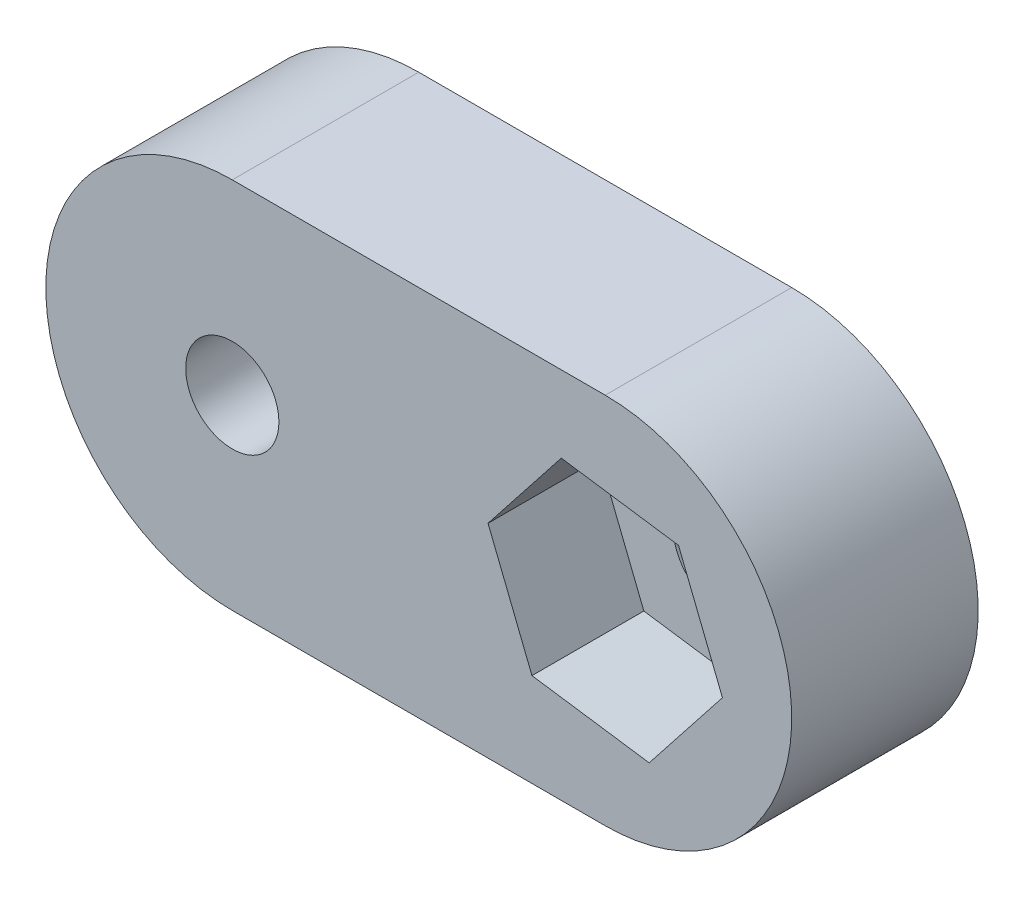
ISO-10303-21;
HEADER;
FILE_DESCRIPTION(('STEP AP214'),'2;1');
FILE_NAME('part.step','',(''),(''),'','','');
FILE_SCHEMA(('AUTOMOTIVE_DESIGN { 1 0 10303 214 1 1 1 1 }'));
ENDSEC;
DATA;
#1=APPLICATION_CONTEXT('core data for automotive mechanical design processes');
#2=APPLICATION_PROTOCOL_DEFINITION('international standard','automotive_design',2000,#1);
#3=PRODUCT_CONTEXT('',#1,'mechanical');
#4=PRODUCT('Part','Part','',(#3));
#5=PRODUCT_RELATED_PRODUCT_CATEGORY('part','',(#4));
#6=PRODUCT_DEFINITION_FORMATION('','',#4);
#7=PRODUCT_DEFINITION_CONTEXT('part definition',#1,'design');
#8=PRODUCT_DEFINITION('design','',#6,#7);
#9=PRODUCT_DEFINITION_SHAPE('','',#8);
#10=(LENGTH_UNIT() NAMED_UNIT(*) SI_UNIT(.MILLI.,.METRE.));
#11=(NAMED_UNIT(*) PLANE_ANGLE_UNIT() SI_UNIT($,.RADIAN.));
#12=(NAMED_UNIT(*) SI_UNIT($,.STERADIAN.) SOLID_ANGLE_UNIT());
#13=UNCERTAINTY_MEASURE_WITH_UNIT(LENGTH_MEASURE(1.E-05),#10,'distance_accuracy_value','');
#14=(GEOMETRIC_REPRESENTATION_CONTEXT(3) GLOBAL_UNCERTAINTY_ASSIGNED_CONTEXT((#13)) GLOBAL_UNIT_ASSIGNED_CONTEXT((#10,
#11,#12)) REPRESENTATION_CONTEXT('',''));
#15=CARTESIAN_POINT('',(0.,0.,0.));
#16=DIRECTION('',(0.,0.,1.));
#17=DIRECTION('',(1.,0.,0.));
#18=AXIS2_PLACEMENT_3D('',#15,#16,#17);
#19=CARTESIAN_POINT('',(1.17833373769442,2.94870529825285,5.));
#20=DIRECTION('',(0.142936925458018,-0.989731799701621,0.));
#21=DIRECTION('',(0.989731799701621,0.142936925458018,0.));
#22=AXIS2_PLACEMENT_3D('',#19,#20,#21);
#23=PLANE('',#22);
#24=DIRECTION('',(0.,0.,-1.));
#25=VECTOR('',#24,1.);
#26=CARTESIAN_POINT('',(1.17833373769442,2.94870529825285,5.));
#27=LINE('',#26,#25);
#28=CARTESIAN_POINT('',(1.17833373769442,2.94870529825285,3.));
#29=VERTEX_POINT('',#28);
#30=CARTESIAN_POINT('',(1.17833373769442,2.94870529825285,0.));
#31=VERTEX_POINT('',#30);
#32=EDGE_CURVE('E241',#29,#31,#27,.T.);
#33=ORIENTED_EDGE('',*,*,#32,.F.);
#34=DIRECTION('',(-0.989731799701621,-0.142936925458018,0.));
#35=VECTOR('',#34,1.);
#36=CARTESIAN_POINT('',(1.17833373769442,2.94870529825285,3.));
#37=LINE('',#36,#35);
#38=CARTESIAN_POINT('',(-1.96448682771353,2.49481960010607,3.));
#39=VERTEX_POINT('',#38);
#40=EDGE_CURVE('E190',#29,#39,#37,.T.);
#41=ORIENTED_EDGE('',*,*,#40,.T.);
#42=DIRECTION('',(0.,0.,-1.));
#43=VECTOR('',#42,1.);
#44=CARTESIAN_POINT('',(-1.96448682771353,2.49481960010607,5.));
#45=LINE('',#44,#43);
#46=CARTESIAN_POINT('',(-1.96448682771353,2.49481960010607,0.));
#47=VERTEX_POINT('',#46);
#48=EDGE_CURVE('E251',#39,#47,#45,.T.);
#49=ORIENTED_EDGE('',*,*,#48,.T.);
#50=DIRECTION('',(-0.989731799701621,-0.142936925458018,0.));
#51=VECTOR('',#50,1.);
#52=CARTESIAN_POINT('',(1.17833373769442,2.94870529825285,0.));
#53=LINE('',#52,#51);
#54=EDGE_CURVE('E223',#31,#47,#53,.T.);
#55=ORIENTED_EDGE('',*,*,#54,.F.);
#56=EDGE_LOOP('',(#33,#41,#49,#55));
#57=FACE_BOUND('',#56,.T.);
#58=ADVANCED_FACE('F34',(#57),#23,.T.);
#59=CARTESIAN_POINT('',(-1.96448682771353,2.49481960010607,5.));
#60=DIRECTION('',(0.928601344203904,-0.371078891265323,0.));
#61=DIRECTION('',(0.371078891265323,0.928601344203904,0.));
#62=AXIS2_PLACEMENT_3D('',#59,#60,#61);
#63=PLANE('',#62);
#64=ORIENTED_EDGE('',*,*,#48,.F.);
#65=DIRECTION('',(-0.371078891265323,-0.928601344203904,0.));
#66=VECTOR('',#65,1.);
#67=CARTESIAN_POINT('',(-1.96448682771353,2.49481960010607,3.));
#68=LINE('',#67,#66);
#69=CARTESIAN_POINT('',(-3.14282056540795,-0.453885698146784,3.));
#70=VERTEX_POINT('',#69);
#71=EDGE_CURVE('E193',#39,#70,#68,.T.);
#72=ORIENTED_EDGE('',*,*,#71,.T.);
#73=DIRECTION('',(0.,0.,-1.));
#74=VECTOR('',#73,1.);
#75=CARTESIAN_POINT('',(-3.14282056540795,-0.453885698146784,5.));
#76=LINE('',#75,#74);
#77=CARTESIAN_POINT('',(-3.14282056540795,-0.453885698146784,0.));
#78=VERTEX_POINT('',#77);
#79=EDGE_CURVE('E249',#70,#78,#76,.T.);
#80=ORIENTED_EDGE('',*,*,#79,.T.);
#81=DIRECTION('',(-0.371078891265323,-0.928601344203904,0.));
#82=VECTOR('',#81,1.);
#83=CARTESIAN_POINT('',(-1.96448682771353,2.49481960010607,0.));
#84=LINE('',#83,#82);
#85=EDGE_CURVE('E226',#47,#78,#84,.T.);
#86=ORIENTED_EDGE('',*,*,#85,.F.);
#87=EDGE_LOOP('',(#64,#72,#80,#86));
#88=FACE_BOUND('',#87,.T.);
#89=ADVANCED_FACE('F307',(#88),#63,.T.);
#90=CARTESIAN_POINT('',(-3.14282056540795,-0.453885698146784,5.));
#91=DIRECTION('',(0.785664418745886,0.618652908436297,0.));
#92=DIRECTION('',(-0.618652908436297,0.785664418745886,0.));
#93=AXIS2_PLACEMENT_3D('',#90,#91,#92);
#94=PLANE('',#93);
#95=ORIENTED_EDGE('',*,*,#79,.F.);
#96=DIRECTION('',(0.618652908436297,-0.785664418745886,0.));
#97=VECTOR('',#96,1.);
#98=CARTESIAN_POINT('',(-3.14282056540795,-0.453885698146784,3.));
#99=LINE('',#98,#97);
#100=CARTESIAN_POINT('',(-1.17833373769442,-2.94870529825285,3.));
#101=VERTEX_POINT('',#100);
#102=EDGE_CURVE('E196',#70,#101,#99,.T.);
#103=ORIENTED_EDGE('',*,*,#102,.T.);
#104=DIRECTION('',(0.,0.,-1.));
#105=VECTOR('',#104,1.);
#106=CARTESIAN_POINT('',(-1.17833373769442,-2.94870529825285,5.));
#107=LINE('',#106,#105);
#108=CARTESIAN_POINT('',(-1.17833373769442,-2.94870529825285,0.));
#109=VERTEX_POINT('',#108);
#110=EDGE_CURVE('E247',#101,#109,#107,.T.);
#111=ORIENTED_EDGE('',*,*,#110,.T.);
#112=DIRECTION('',(0.618652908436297,-0.785664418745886,0.));
#113=VECTOR('',#112,1.);
#114=CARTESIAN_POINT('',(-3.14282056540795,-0.453885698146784,0.));
#115=LINE('',#114,#113);
#116=EDGE_CURVE('E229',#78,#109,#115,.T.);
#117=ORIENTED_EDGE('',*,*,#116,.F.);
#118=EDGE_LOOP('',(#95,#103,#111,#117));
#119=FACE_BOUND('',#118,.T.);
#120=ADVANCED_FACE('F313',(#119),#94,.T.);
#121=CARTESIAN_POINT('',(-1.17833373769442,-2.94870529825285,5.));
#122=DIRECTION('',(-0.142936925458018,0.989731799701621,0.));
#123=DIRECTION('',(-0.989731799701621,-0.142936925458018,0.));
#124=AXIS2_PLACEMENT_3D('',#121,#122,#123);
#125=PLANE('',#124);
#126=ORIENTED_EDGE('',*,*,#110,.F.);
#127=DIRECTION('',(0.989731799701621,0.142936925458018,0.));
#128=VECTOR('',#127,1.);
#129=CARTESIAN_POINT('',(-1.17833373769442,-2.94870529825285,3.));
#130=LINE('',#129,#128);
#131=CARTESIAN_POINT('',(1.96448682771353,-2.49481960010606,3.));
#132=VERTEX_POINT('',#131);
#133=EDGE_CURVE('E199',#101,#132,#130,.T.);
#134=ORIENTED_EDGE('',*,*,#133,.T.);
#135=DIRECTION('',(0.,0.,-1.));
#136=VECTOR('',#135,1.);
#137=CARTESIAN_POINT('',(1.96448682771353,-2.49481960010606,5.));
#138=LINE('',#137,#136);
#139=CARTESIAN_POINT('',(1.96448682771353,-2.49481960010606,0.));
#140=VERTEX_POINT('',#139);
#141=EDGE_CURVE('E245',#132,#140,#138,.T.);
#142=ORIENTED_EDGE('',*,*,#141,.T.);
#143=DIRECTION('',(0.989731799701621,0.142936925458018,0.));
#144=VECTOR('',#143,1.);
#145=CARTESIAN_POINT('',(-1.17833373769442,-2.94870529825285,0.));
#146=LINE('',#145,#144);
#147=EDGE_CURVE('E232',#109,#140,#146,.T.);
#148=ORIENTED_EDGE('',*,*,#147,.F.);
#149=EDGE_LOOP('',(#126,#134,#142,#148));
#150=FACE_BOUND('',#149,.T.);
#151=ADVANCED_FACE('F344',(#150),#125,.T.);
#152=CARTESIAN_POINT('',(1.96448682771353,-2.49481960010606,5.));
#153=DIRECTION('',(-0.928601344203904,0.371078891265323,0.));
#154=DIRECTION('',(-0.371078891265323,-0.928601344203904,0.));
#155=AXIS2_PLACEMENT_3D('',#152,#153,#154);
#156=PLANE('',#155);
#157=ORIENTED_EDGE('',*,*,#141,.F.);
#158=DIRECTION('',(0.371078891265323,0.928601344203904,0.));
#159=VECTOR('',#158,1.);
#160=CARTESIAN_POINT('',(1.96448682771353,-2.49481960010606,3.));
#161=LINE('',#160,#159);
#162=CARTESIAN_POINT('',(3.14282056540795,0.453885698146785,3.));
#163=VERTEX_POINT('',#162);
#164=EDGE_CURVE('E182',#132,#163,#161,.T.);
#165=ORIENTED_EDGE('',*,*,#164,.T.);
#166=DIRECTION('',(0.,0.,-1.));
#167=VECTOR('',#166,1.);
#168=CARTESIAN_POINT('',(3.14282056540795,0.453885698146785,5.));
#169=LINE('',#168,#167);
#170=CARTESIAN_POINT('',(3.14282056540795,0.453885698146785,0.));
#171=VERTEX_POINT('',#170);
#172=EDGE_CURVE('E243',#163,#171,#169,.T.);
#173=ORIENTED_EDGE('',*,*,#172,.T.);
#174=DIRECTION('',(0.371078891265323,0.928601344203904,0.));
#175=VECTOR('',#174,1.);
#176=CARTESIAN_POINT('',(1.96448682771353,-2.49481960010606,0.));
#177=LINE('',#176,#175);
#178=EDGE_CURVE('E235',#140,#171,#177,.T.);
#179=ORIENTED_EDGE('',*,*,#178,.F.);
#180=EDGE_LOOP('',(#157,#165,#173,#179));
#181=FACE_BOUND('',#180,.T.);
#182=ADVANCED_FACE('F340',(#181),#156,.T.);
#183=CARTESIAN_POINT('',(3.14282056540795,0.453885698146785,5.));
#184=DIRECTION('',(-0.785664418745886,-0.618652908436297,0.));
#185=DIRECTION('',(0.618652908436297,-0.785664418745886,0.));
#186=AXIS2_PLACEMENT_3D('',#183,#184,#185);
#187=PLANE('',#186);
#188=ORIENTED_EDGE('',*,*,#172,.F.);
#189=DIRECTION('',(-0.618652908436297,0.785664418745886,0.));
#190=VECTOR('',#189,1.);
#191=CARTESIAN_POINT('',(3.14282056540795,0.453885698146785,3.));
#192=LINE('',#191,#190);
#193=EDGE_CURVE('E187',#163,#29,#192,.T.);
#194=ORIENTED_EDGE('',*,*,#193,.T.);
#195=ORIENTED_EDGE('',*,*,#32,.T.);
#196=DIRECTION('',(-0.618652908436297,0.785664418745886,0.));
#197=VECTOR('',#196,1.);
#198=CARTESIAN_POINT('',(3.14282056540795,0.453885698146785,0.));
#199=LINE('',#198,#197);
#200=EDGE_CURVE('E238',#171,#31,#199,.T.);
#201=ORIENTED_EDGE('',*,*,#200,.F.);
#202=EDGE_LOOP('',(#188,#194,#195,#201));
#203=FACE_BOUND('',#202,.T.);
#204=ADVANCED_FACE('F321',(#203),#187,.T.);
#205=CARTESIAN_POINT('',(0.,0.,5.));
#206=DIRECTION('',(0.,0.,1.));
#207=DIRECTION('',(1.,0.,0.));
#208=AXIS2_PLACEMENT_3D('',#205,#206,#207);
#209=PLANE('',#208);
#210=CARTESIAN_POINT('',(0.,0.,5.));
#211=DIRECTION('',(0.,0.,1.));
#212=DIRECTION('',(1.,0.,0.));
#213=AXIS2_PLACEMENT_3D('',#210,#211,#212);
#214=CIRCLE('',#213,5.);
#215=CARTESIAN_POINT('',(0.,5.,5.));
#216=VERTEX_POINT('',#215);
#217=CARTESIAN_POINT('',(0.,-5.,5.));
#218=VERTEX_POINT('',#217);
#219=EDGE_CURVE('E254',#216,#218,#214,.T.);
#220=ORIENTED_EDGE('',*,*,#219,.T.);
#221=DIRECTION('',(1.,0.,0.));
#222=VECTOR('',#221,1.);
#223=CARTESIAN_POINT('',(0.,-5.,5.));
#224=LINE('',#223,#222);
#225=CARTESIAN_POINT('',(10.,-5.,5.));
#226=VERTEX_POINT('',#225);
#227=EDGE_CURVE('E257',#218,#226,#224,.T.);
#228=ORIENTED_EDGE('',*,*,#227,.T.);
#229=CARTESIAN_POINT('',(10.,0.,5.));
#230=DIRECTION('',(0.,0.,1.));
#231=DIRECTION('',(1.,0.,0.));
#232=AXIS2_PLACEMENT_3D('',#229,#230,#231);
#233=CIRCLE('',#232,5.);
#234=CARTESIAN_POINT('',(10.,5.,5.));
#235=VERTEX_POINT('',#234);
#236=EDGE_CURVE('E260',#226,#235,#233,.T.);
#237=ORIENTED_EDGE('',*,*,#236,.T.);
#238=DIRECTION('',(-1.,0.,0.));
#239=VECTOR('',#238,1.);
#240=CARTESIAN_POINT('',(0.,5.,5.));
#241=LINE('',#240,#239);
#242=EDGE_CURVE('E262',#235,#216,#241,.T.);
#243=ORIENTED_EDGE('',*,*,#242,.T.);
#244=EDGE_LOOP('',(#220,#228,#237,#243));
#245=FACE_BOUND('',#244,.T.);
#246=DIRECTION('',(-0.989731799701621,0.142936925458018,0.));
#247=VECTOR('',#246,1.);
#248=CARTESIAN_POINT('',(8.82166626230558,2.94870529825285,5.));
#249=LINE('',#248,#247);
#250=CARTESIAN_POINT('',(11.9644868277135,2.49481960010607,5.));
#251=VERTEX_POINT('',#250);
#252=CARTESIAN_POINT('',(8.82166626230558,2.94870529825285,5.));
#253=VERTEX_POINT('',#252);
#254=EDGE_CURVE('E204',#251,#253,#249,.T.);
#255=ORIENTED_EDGE('',*,*,#254,.F.);
#256=DIRECTION('',(-0.371078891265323,0.928601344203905,0.));
#257=VECTOR('',#256,1.);
#258=CARTESIAN_POINT('',(11.9644868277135,2.49481960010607,5.));
#259=LINE('',#258,#257);
#260=CARTESIAN_POINT('',(13.1428205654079,-0.453885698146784,5.));
#261=VERTEX_POINT('',#260);
#262=EDGE_CURVE('E202',#261,#251,#259,.T.);
#263=ORIENTED_EDGE('',*,*,#262,.F.);
#264=DIRECTION('',(0.618652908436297,0.785664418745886,0.));
#265=VECTOR('',#264,1.);
#266=CARTESIAN_POINT('',(13.1428205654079,-0.453885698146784,5.));
#267=LINE('',#266,#265);
#268=CARTESIAN_POINT('',(11.1783337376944,-2.94870529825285,5.));
#269=VERTEX_POINT('',#268);
#270=EDGE_CURVE('E156',#269,#261,#267,.T.);
#271=ORIENTED_EDGE('',*,*,#270,.F.);
#272=DIRECTION('',(0.989731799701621,-0.142936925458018,0.));
#273=VECTOR('',#272,1.);
#274=CARTESIAN_POINT('',(11.1783337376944,-2.94870529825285,5.));
#275=LINE('',#274,#273);
#276=CARTESIAN_POINT('',(8.03551317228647,-2.49481960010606,5.));
#277=VERTEX_POINT('',#276);
#278=EDGE_CURVE('E210',#277,#269,#275,.T.);
#279=ORIENTED_EDGE('',*,*,#278,.F.);
#280=DIRECTION('',(0.371078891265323,-0.928601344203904,0.));
#281=VECTOR('',#280,1.);
#282=CARTESIAN_POINT('',(8.03551317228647,-2.49481960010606,5.));
#283=LINE('',#282,#281);
#284=CARTESIAN_POINT('',(6.85717943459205,0.453885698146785,5.));
#285=VERTEX_POINT('',#284);
#286=EDGE_CURVE('E208',#285,#277,#283,.T.);
#287=ORIENTED_EDGE('',*,*,#286,.F.);
#288=DIRECTION('',(-0.618652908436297,-0.785664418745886,0.));
#289=VECTOR('',#288,1.);
#290=CARTESIAN_POINT('',(6.85717943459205,0.453885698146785,5.));
#291=LINE('',#290,#289);
#292=EDGE_CURVE('E206',#253,#285,#291,.T.);
#293=ORIENTED_EDGE('',*,*,#292,.F.);
#294=EDGE_LOOP('',(#255,#263,#271,#279,#287,#293));
#295=FACE_BOUND('',#294,.T.);
#296=CARTESIAN_POINT('',(0.,0.,5.));
#297=DIRECTION('',(0.,0.,1.));
#298=DIRECTION('',(1.,0.,0.));
#299=AXIS2_PLACEMENT_3D('',#296,#297,#298);
#300=CIRCLE('',#299,1.25);
#301=CARTESIAN_POINT('',(1.25,0.,5.));
#302=VERTEX_POINT('',#301);
#303=EDGE_CURVE('E178',#302,#302,#300,.T.);
#304=ORIENTED_EDGE('',*,*,#303,.F.);
#305=EDGE_LOOP('',(#304));
#306=FACE_BOUND('',#305,.T.);
#307=ADVANCED_FACE('F297',(#245,#295,#306),#209,.T.);
#308=CARTESIAN_POINT('',(0.,0.,0.));
#309=DIRECTION('',(0.,0.,1.));
#310=DIRECTION('',(1.,0.,0.));
#311=AXIS2_PLACEMENT_3D('',#308,#309,#310);
#312=PLANE('',#311);
#313=ORIENTED_EDGE('',*,*,#54,.T.);
#314=ORIENTED_EDGE('',*,*,#85,.T.);
#315=ORIENTED_EDGE('',*,*,#116,.T.);
#316=ORIENTED_EDGE('',*,*,#147,.T.);
#317=ORIENTED_EDGE('',*,*,#178,.T.);
#318=ORIENTED_EDGE('',*,*,#200,.T.);
#319=EDGE_LOOP('',(#313,#314,#315,#316,#317,#318));
#320=FACE_BOUND('',#319,.T.);
#321=CARTESIAN_POINT('',(0.,0.,0.));
#322=DIRECTION('',(0.,0.,1.));
#323=DIRECTION('',(1.,0.,0.));
#324=AXIS2_PLACEMENT_3D('',#321,#322,#323);
#325=CIRCLE('',#324,5.);
#326=CARTESIAN_POINT('',(0.,5.,0.));
#327=VERTEX_POINT('',#326);
#328=CARTESIAN_POINT('',(0.,-5.,0.));
#329=VERTEX_POINT('',#328);
#330=EDGE_CURVE('E253',#327,#329,#325,.T.);
#331=ORIENTED_EDGE('',*,*,#330,.F.);
#332=DIRECTION('',(-1.,0.,0.));
#333=VECTOR('',#332,1.);
#334=CARTESIAN_POINT('',(0.,5.,0.));
#335=LINE('',#334,#333);
#336=CARTESIAN_POINT('',(10.,5.,0.));
#337=VERTEX_POINT('',#336);
#338=EDGE_CURVE('E258',#337,#327,#335,.T.);
#339=ORIENTED_EDGE('',*,*,#338,.F.);
#340=CARTESIAN_POINT('',(10.,0.,0.));
#341=DIRECTION('',(0.,0.,1.));
#342=DIRECTION('',(1.,0.,0.));
#343=AXIS2_PLACEMENT_3D('',#340,#341,#342);
#344=CIRCLE('',#343,5.);
#345=CARTESIAN_POINT('',(10.,-5.,0.));
#346=VERTEX_POINT('',#345);
#347=EDGE_CURVE('E269',#346,#337,#344,.T.);
#348=ORIENTED_EDGE('',*,*,#347,.F.);
#349=DIRECTION('',(1.,0.,0.));
#350=VECTOR('',#349,1.);
#351=CARTESIAN_POINT('',(0.,-5.,0.));
#352=LINE('',#351,#350);
#353=EDGE_CURVE('E267',#329,#346,#352,.T.);
#354=ORIENTED_EDGE('',*,*,#353,.F.);
#355=EDGE_LOOP('',(#331,#339,#348,#354));
#356=FACE_BOUND('',#355,.T.);
#357=CARTESIAN_POINT('',(10.080340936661,-0.20104808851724,0.));
#358=DIRECTION('',(0.,0.,-1.));
#359=DIRECTION('',(-1.,0.,0.));
#360=AXIS2_PLACEMENT_3D('',#357,#358,#359);
#361=CIRCLE('',#360,1.25);
#362=CARTESIAN_POINT('',(8.83034093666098,-0.20104808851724,0.));
#363=VERTEX_POINT('',#362);
#364=EDGE_CURVE('E432',#363,#363,#361,.T.);
#365=ORIENTED_EDGE('',*,*,#364,.F.);
#366=EDGE_LOOP('',(#365));
#367=FACE_BOUND('',#366,.T.);
#368=ADVANCED_FACE('F287',(#320,#356,#367),#312,.F.);
#369=CARTESIAN_POINT('',(0.,0.,5.));
#370=DIRECTION('',(0.,0.,-1.));
#371=DIRECTION('',(-1.,0.,0.));
#372=AXIS2_PLACEMENT_3D('',#369,#370,#371);
#373=CYLINDRICAL_SURFACE('',#372,5.);
#374=ORIENTED_EDGE('',*,*,#330,.T.);
#375=DIRECTION('',(0.,0.,-1.));
#376=VECTOR('',#375,1.);
#377=CARTESIAN_POINT('',(0.,-5.,5.));
#378=LINE('',#377,#376);
#379=EDGE_CURVE('E11',#218,#329,#378,.T.);
#380=ORIENTED_EDGE('',*,*,#379,.F.);
#381=ORIENTED_EDGE('',*,*,#219,.F.);
#382=DIRECTION('',(0.,0.,-1.));
#383=VECTOR('',#382,1.);
#384=CARTESIAN_POINT('',(0.,5.,5.));
#385=LINE('',#384,#383);
#386=EDGE_CURVE('E264',#216,#327,#385,.T.);
#387=ORIENTED_EDGE('',*,*,#386,.T.);
#388=EDGE_LOOP('',(#374,#380,#381,#387));
#389=FACE_BOUND('',#388,.T.);
#390=ADVANCED_FACE('F36',(#389),#373,.T.);
#391=CARTESIAN_POINT('',(0.,-5.,5.));
#392=DIRECTION('',(0.,1.,0.));
#393=DIRECTION('',(0.,0.,1.));
#394=AXIS2_PLACEMENT_3D('',#391,#392,#393);
#395=PLANE('',#394);
#396=ORIENTED_EDGE('',*,*,#353,.T.);
#397=DIRECTION('',(0.,0.,-1.));
#398=VECTOR('',#397,1.);
#399=CARTESIAN_POINT('',(10.,-5.,5.));
#400=LINE('',#399,#398);
#401=EDGE_CURVE('E42',#226,#346,#400,.T.);
#402=ORIENTED_EDGE('',*,*,#401,.F.);
#403=ORIENTED_EDGE('',*,*,#227,.F.);
#404=ORIENTED_EDGE('',*,*,#379,.T.);
#405=EDGE_LOOP('',(#396,#402,#403,#404));
#406=FACE_BOUND('',#405,.T.);
#407=ADVANCED_FACE('F299',(#406),#395,.F.);
#408=CARTESIAN_POINT('',(10.,0.,5.));
#409=DIRECTION('',(0.,0.,-1.));
#410=DIRECTION('',(-1.,0.,0.));
#411=AXIS2_PLACEMENT_3D('',#408,#409,#410);
#412=CYLINDRICAL_SURFACE('',#411,5.);
#413=ORIENTED_EDGE('',*,*,#347,.T.);
#414=DIRECTION('',(0.,0.,-1.));
#415=VECTOR('',#414,1.);
#416=CARTESIAN_POINT('',(10.,5.,5.));
#417=LINE('',#416,#415);
#418=EDGE_CURVE('E274',#235,#337,#417,.T.);
#419=ORIENTED_EDGE('',*,*,#418,.F.);
#420=ORIENTED_EDGE('',*,*,#236,.F.);
#421=ORIENTED_EDGE('',*,*,#401,.T.);
#422=EDGE_LOOP('',(#413,#419,#420,#421));
#423=FACE_BOUND('',#422,.T.);
#424=ADVANCED_FACE('F281',(#423),#412,.T.);
#425=CARTESIAN_POINT('',(0.,5.,5.));
#426=DIRECTION('',(0.,-1.,0.));
#427=DIRECTION('',(0.,0.,-1.));
#428=AXIS2_PLACEMENT_3D('',#425,#426,#427);
#429=PLANE('',#428);
#430=ORIENTED_EDGE('',*,*,#338,.T.);
#431=ORIENTED_EDGE('',*,*,#386,.F.);
#432=ORIENTED_EDGE('',*,*,#242,.F.);
#433=ORIENTED_EDGE('',*,*,#418,.T.);
#434=EDGE_LOOP('',(#430,#431,#432,#433));
#435=FACE_BOUND('',#434,.T.);
#436=ADVANCED_FACE('F291',(#435),#429,.F.);
#437=CARTESIAN_POINT('',(11.9644868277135,2.49481960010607,5.));
#438=DIRECTION('',(-0.928601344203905,-0.371078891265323,0.));
#439=DIRECTION('',(0.371078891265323,-0.928601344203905,0.));
#440=AXIS2_PLACEMENT_3D('',#437,#438,#439);
#441=PLANE('',#440);
#442=DIRECTION('',(0.371078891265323,-0.928601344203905,0.));
#443=VECTOR('',#442,1.);
#444=CARTESIAN_POINT('',(13.1428205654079,-0.453885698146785,2.));
#445=LINE('',#444,#443);
#446=CARTESIAN_POINT('',(11.9644868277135,2.49481960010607,2.));
#447=VERTEX_POINT('',#446);
#448=CARTESIAN_POINT('',(13.1428205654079,-0.453885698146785,2.));
#449=VERTEX_POINT('',#448);
#450=EDGE_CURVE('E162',#447,#449,#445,.T.);
#451=ORIENTED_EDGE('',*,*,#450,.T.);
#452=DIRECTION('',(0.,0.,-1.));
#453=VECTOR('',#452,1.);
#454=CARTESIAN_POINT('',(13.1428205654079,-0.453885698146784,5.));
#455=LINE('',#454,#453);
#456=EDGE_CURVE('E149',#261,#449,#455,.T.);
#457=ORIENTED_EDGE('',*,*,#456,.F.);
#458=ORIENTED_EDGE('',*,*,#262,.T.);
#459=DIRECTION('',(0.,0.,-1.));
#460=VECTOR('',#459,1.);
#461=CARTESIAN_POINT('',(11.9644868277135,2.49481960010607,5.));
#462=LINE('',#461,#460);
#463=EDGE_CURVE('E164',#251,#447,#462,.T.);
#464=ORIENTED_EDGE('',*,*,#463,.T.);
#465=EDGE_LOOP('',(#451,#457,#458,#464));
#466=FACE_BOUND('',#465,.T.);
#467=ADVANCED_FACE('F163',(#466),#441,.T.);
#468=CARTESIAN_POINT('',(8.82166626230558,2.94870529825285,5.));
#469=DIRECTION('',(-0.142936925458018,-0.989731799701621,0.));
#470=DIRECTION('',(0.989731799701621,-0.142936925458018,0.));
#471=AXIS2_PLACEMENT_3D('',#468,#469,#470);
#472=PLANE('',#471);
#473=DIRECTION('',(0.989731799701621,-0.142936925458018,0.));
#474=VECTOR('',#473,1.);
#475=CARTESIAN_POINT('',(11.9644868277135,2.49481960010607,2.));
#476=LINE('',#475,#474);
#477=CARTESIAN_POINT('',(8.82166626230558,2.94870529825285,2.));
#478=VERTEX_POINT('',#477);
#479=EDGE_CURVE('E49',#478,#447,#476,.T.);
#480=ORIENTED_EDGE('',*,*,#479,.T.);
#481=ORIENTED_EDGE('',*,*,#463,.F.);
#482=ORIENTED_EDGE('',*,*,#254,.T.);
#483=DIRECTION('',(0.,0.,-1.));
#484=VECTOR('',#483,1.);
#485=CARTESIAN_POINT('',(8.82166626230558,2.94870529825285,5.));
#486=LINE('',#485,#484);
#487=EDGE_CURVE('E220',#253,#478,#486,.T.);
#488=ORIENTED_EDGE('',*,*,#487,.T.);
#489=EDGE_LOOP('',(#480,#481,#482,#488));
#490=FACE_BOUND('',#489,.T.);
#491=ADVANCED_FACE('F329',(#490),#472,.T.);
#492=CARTESIAN_POINT('',(6.85717943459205,0.453885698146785,5.));
#493=DIRECTION('',(0.785664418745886,-0.618652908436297,0.));
#494=DIRECTION('',(0.618652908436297,0.785664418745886,0.));
#495=AXIS2_PLACEMENT_3D('',#492,#493,#494);
#496=PLANE('',#495);
#497=DIRECTION('',(0.618652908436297,0.785664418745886,0.));
#498=VECTOR('',#497,1.);
#499=CARTESIAN_POINT('',(8.82166626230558,2.94870529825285,2.));
#500=LINE('',#499,#498);
#501=CARTESIAN_POINT('',(6.85717943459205,0.453885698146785,2.));
#502=VERTEX_POINT('',#501);
#503=EDGE_CURVE('E57',#502,#478,#500,.T.);
#504=ORIENTED_EDGE('',*,*,#503,.T.);
#505=ORIENTED_EDGE('',*,*,#487,.F.);
#506=ORIENTED_EDGE('',*,*,#292,.T.);
#507=DIRECTION('',(0.,0.,-1.));
#508=VECTOR('',#507,1.);
#509=CARTESIAN_POINT('',(6.85717943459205,0.453885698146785,5.));
#510=LINE('',#509,#508);
#511=EDGE_CURVE('E218',#285,#502,#510,.T.);
#512=ORIENTED_EDGE('',*,*,#511,.T.);
#513=EDGE_LOOP('',(#504,#505,#506,#512));
#514=FACE_BOUND('',#513,.T.);
#515=ADVANCED_FACE('F334',(#514),#496,.T.);
#516=CARTESIAN_POINT('',(8.03551317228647,-2.49481960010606,5.));
#517=DIRECTION('',(0.928601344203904,0.371078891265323,0.));
#518=DIRECTION('',(-0.371078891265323,0.928601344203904,0.));
#519=AXIS2_PLACEMENT_3D('',#516,#517,#518);
#520=PLANE('',#519);
#521=DIRECTION('',(-0.371078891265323,0.928601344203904,0.));
#522=VECTOR('',#521,1.);
#523=CARTESIAN_POINT('',(6.85717943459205,0.453885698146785,2.));
#524=LINE('',#523,#522);
#525=CARTESIAN_POINT('',(8.03551317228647,-2.49481960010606,2.));
#526=VERTEX_POINT('',#525);
#527=EDGE_CURVE('E172',#526,#502,#524,.T.);
#528=ORIENTED_EDGE('',*,*,#527,.T.);
#529=ORIENTED_EDGE('',*,*,#511,.F.);
#530=ORIENTED_EDGE('',*,*,#286,.T.);
#531=DIRECTION('',(0.,0.,-1.));
#532=VECTOR('',#531,1.);
#533=CARTESIAN_POINT('',(8.03551317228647,-2.49481960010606,5.));
#534=LINE('',#533,#532);
#535=EDGE_CURVE('E215',#277,#526,#534,.T.);
#536=ORIENTED_EDGE('',*,*,#535,.T.);
#537=EDGE_LOOP('',(#528,#529,#530,#536));
#538=FACE_BOUND('',#537,.T.);
#539=ADVANCED_FACE('F381',(#538),#520,.T.);
#540=CARTESIAN_POINT('',(11.1783337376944,-2.94870529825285,5.));
#541=DIRECTION('',(0.142936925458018,0.989731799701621,0.));
#542=DIRECTION('',(-0.989731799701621,0.142936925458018,0.));
#543=AXIS2_PLACEMENT_3D('',#540,#541,#542);
#544=PLANE('',#543);
#545=DIRECTION('',(-0.989731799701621,0.142936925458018,0.));
#546=VECTOR('',#545,1.);
#547=CARTESIAN_POINT('',(8.03551317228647,-2.49481960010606,2.));
#548=LINE('',#547,#546);
#549=CARTESIAN_POINT('',(11.1783337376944,-2.94870529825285,2.));
#550=VERTEX_POINT('',#549);
#551=EDGE_CURVE('E170',#550,#526,#548,.T.);
#552=ORIENTED_EDGE('',*,*,#551,.T.);
#553=ORIENTED_EDGE('',*,*,#535,.F.);
#554=ORIENTED_EDGE('',*,*,#278,.T.);
#555=DIRECTION('',(0.,0.,-1.));
#556=VECTOR('',#555,1.);
#557=CARTESIAN_POINT('',(11.1783337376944,-2.94870529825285,5.));
#558=LINE('',#557,#556);
#559=EDGE_CURVE('E159',#269,#550,#558,.T.);
#560=ORIENTED_EDGE('',*,*,#559,.T.);
#561=EDGE_LOOP('',(#552,#553,#554,#560));
#562=FACE_BOUND('',#561,.T.);
#563=ADVANCED_FACE('F375',(#562),#544,.T.);
#564=CARTESIAN_POINT('',(13.1428205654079,-0.453885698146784,5.));
#565=DIRECTION('',(-0.785664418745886,0.618652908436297,0.));
#566=DIRECTION('',(-0.618652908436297,-0.785664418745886,0.));
#567=AXIS2_PLACEMENT_3D('',#564,#565,#566);
#568=PLANE('',#567);
#569=DIRECTION('',(-0.618652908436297,-0.785664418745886,0.));
#570=VECTOR('',#569,1.);
#571=CARTESIAN_POINT('',(11.1783337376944,-2.94870529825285,2.));
#572=LINE('',#571,#570);
#573=EDGE_CURVE('E153',#449,#550,#572,.T.);
#574=ORIENTED_EDGE('',*,*,#573,.T.);
#575=ORIENTED_EDGE('',*,*,#559,.F.);
#576=ORIENTED_EDGE('',*,*,#270,.T.);
#577=ORIENTED_EDGE('',*,*,#456,.T.);
#578=EDGE_LOOP('',(#574,#575,#576,#577));
#579=FACE_BOUND('',#578,.T.);
#580=ADVANCED_FACE('F151',(#579),#568,.T.);
#581=CARTESIAN_POINT('',(0.,0.,3.));
#582=DIRECTION('',(0.,0.,1.));
#583=DIRECTION('',(1.,0.,0.));
#584=AXIS2_PLACEMENT_3D('',#581,#582,#583);
#585=PLANE('',#584);
#586=CARTESIAN_POINT('',(0.,0.,3.));
#587=DIRECTION('',(0.,0.,1.));
#588=DIRECTION('',(1.,0.,0.));
#589=AXIS2_PLACEMENT_3D('',#586,#587,#588);
#590=CIRCLE('',#589,1.25);
#591=CARTESIAN_POINT('',(1.25,0.,3.));
#592=VERTEX_POINT('',#591);
#593=EDGE_CURVE('E179',#592,#592,#590,.T.);
#594=ORIENTED_EDGE('',*,*,#593,.T.);
#595=EDGE_LOOP('',(#594));
#596=FACE_BOUND('',#595,.T.);
#597=ORIENTED_EDGE('',*,*,#164,.F.);
#598=ORIENTED_EDGE('',*,*,#133,.F.);
#599=ORIENTED_EDGE('',*,*,#102,.F.);
#600=ORIENTED_EDGE('',*,*,#71,.F.);
#601=ORIENTED_EDGE('',*,*,#40,.F.);
#602=ORIENTED_EDGE('',*,*,#193,.F.);
#603=EDGE_LOOP('',(#597,#598,#599,#600,#601,#602));
#604=FACE_BOUND('',#603,.T.);
#605=ADVANCED_FACE('F358',(#596,#604),#585,.F.);
#606=CARTESIAN_POINT('',(0.,0.,3.));
#607=DIRECTION('',(0.,0.,1.));
#608=DIRECTION('',(1.,0.,0.));
#609=AXIS2_PLACEMENT_3D('',#606,#607,#608);
#610=CYLINDRICAL_SURFACE('',#609,1.25);
#611=ORIENTED_EDGE('',*,*,#593,.F.);
#612=EDGE_LOOP('',(#611));
#613=FACE_BOUND('',#612,.T.);
#614=ORIENTED_EDGE('',*,*,#303,.T.);
#615=EDGE_LOOP('',(#614));
#616=FACE_BOUND('',#615,.T.);
#617=ADVANCED_FACE('F366',(#613,#616),#610,.F.);
#618=CARTESIAN_POINT('',(0.,0.,2.));
#619=DIRECTION('',(0.,0.,1.));
#620=DIRECTION('',(1.,0.,0.));
#621=AXIS2_PLACEMENT_3D('',#618,#619,#620);
#622=PLANE('',#621);
#623=CARTESIAN_POINT('',(10.080340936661,-0.20104808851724,2.));
#624=DIRECTION('',(0.,0.,-1.));
#625=DIRECTION('',(-1.,0.,0.));
#626=AXIS2_PLACEMENT_3D('',#623,#624,#625);
#627=CIRCLE('',#626,1.25);
#628=CARTESIAN_POINT('',(8.83034093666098,-0.20104808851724,2.));
#629=VERTEX_POINT('',#628);
#630=EDGE_CURVE('E429',#629,#629,#627,.T.);
#631=ORIENTED_EDGE('',*,*,#630,.T.);
#632=EDGE_LOOP('',(#631));
#633=FACE_BOUND('',#632,.T.);
#634=ORIENTED_EDGE('',*,*,#479,.F.);
#635=ORIENTED_EDGE('',*,*,#503,.F.);
#636=ORIENTED_EDGE('',*,*,#527,.F.);
#637=ORIENTED_EDGE('',*,*,#551,.F.);
#638=ORIENTED_EDGE('',*,*,#573,.F.);
#639=ORIENTED_EDGE('',*,*,#450,.F.);
#640=EDGE_LOOP('',(#634,#635,#636,#637,#638,#639));
#641=FACE_BOUND('',#640,.T.);
#642=ADVANCED_FACE('F168',(#633,#641),#622,.T.);
#643=CARTESIAN_POINT('',(10.080340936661,-0.20104808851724,2.));
#644=DIRECTION('',(0.,0.,-1.));
#645=DIRECTION('',(-1.,0.,0.));
#646=AXIS2_PLACEMENT_3D('',#643,#644,#645);
#647=CYLINDRICAL_SURFACE('',#646,1.25);
#648=ORIENTED_EDGE('',*,*,#630,.F.);
#649=EDGE_LOOP('',(#648));
#650=FACE_BOUND('',#649,.T.);
#651=ORIENTED_EDGE('',*,*,#364,.T.);
#652=EDGE_LOOP('',(#651));
#653=FACE_BOUND('',#652,.T.);
#654=ADVANCED_FACE('F412',(#650,#653),#647,.F.);
#655=CLOSED_SHELL('',(#58,#89,#120,#151,#182,#204,#307,#368,#390,#407,#424,#436,#467,#491,#515,
#539,#563,#580,#605,#617,#642,#654));
#656=MANIFOLD_SOLID_BREP('B2',#655);
#657=ADVANCED_BREP_SHAPE_REPRESENTATION('',(#18,#656),#14);
#658=SHAPE_DEFINITION_REPRESENTATION(#9,#657);
ENDSEC;
END-ISO-10303-21;
